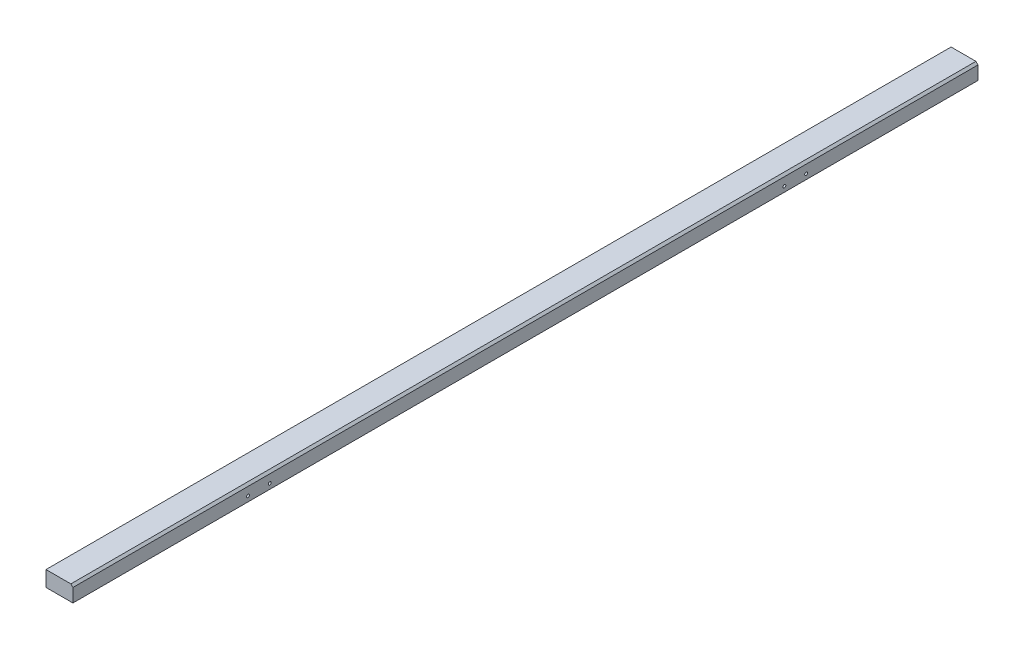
ISO-10303-21;
HEADER;
FILE_DESCRIPTION(('STEP AP214'),'2;1');
FILE_NAME('part.step','',(''),(''),'','','');
FILE_SCHEMA(('AUTOMOTIVE_DESIGN { 1 0 10303 214 1 1 1 1 }'));
ENDSEC;
DATA;
#1=APPLICATION_CONTEXT('core data for automotive mechanical design processes');
#2=APPLICATION_PROTOCOL_DEFINITION('international standard','automotive_design',2000,#1);
#3=PRODUCT_CONTEXT('',#1,'mechanical');
#4=PRODUCT('Part','Part','',(#3));
#5=PRODUCT_RELATED_PRODUCT_CATEGORY('part','',(#4));
#6=PRODUCT_DEFINITION_FORMATION('','',#4);
#7=PRODUCT_DEFINITION_CONTEXT('part definition',#1,'design');
#8=PRODUCT_DEFINITION('design','',#6,#7);
#9=PRODUCT_DEFINITION_SHAPE('','',#8);
#10=(LENGTH_UNIT() NAMED_UNIT(*) SI_UNIT(.MILLI.,.METRE.));
#11=(NAMED_UNIT(*) PLANE_ANGLE_UNIT() SI_UNIT($,.RADIAN.));
#12=(NAMED_UNIT(*) SI_UNIT($,.STERADIAN.) SOLID_ANGLE_UNIT());
#13=UNCERTAINTY_MEASURE_WITH_UNIT(LENGTH_MEASURE(1.E-05),#10,'distance_accuracy_value','');
#14=(GEOMETRIC_REPRESENTATION_CONTEXT(3) GLOBAL_UNCERTAINTY_ASSIGNED_CONTEXT((#13)) GLOBAL_UNIT_ASSIGNED_CONTEXT((#10,
#11,#12)) REPRESENTATION_CONTEXT('',''));
#15=CARTESIAN_POINT('',(0.,0.,0.));
#16=DIRECTION('',(0.,0.,1.));
#17=DIRECTION('',(1.,0.,0.));
#18=AXIS2_PLACEMENT_3D('',#15,#16,#17);
#19=CARTESIAN_POINT('',(0.,0.,1748.));
#20=DIRECTION('',(1.,0.,0.));
#21=DIRECTION('',(0.,0.,-1.));
#22=AXIS2_PLACEMENT_3D('',#19,#20,#21);
#23=PLANE('',#22);
#24=CARTESIAN_POINT('',(0.,10.,1410.));
#25=DIRECTION('',(1.,0.,0.));
#26=DIRECTION('',(0.,0.,-1.));
#27=AXIS2_PLACEMENT_3D('',#24,#25,#26);
#28=CIRCLE('',#27,2.74999999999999);
#29=CARTESIAN_POINT('',(0.,10.,1407.25));
#30=VERTEX_POINT('',#29);
#31=EDGE_CURVE('E140',#30,#30,#28,.T.);
#32=ORIENTED_EDGE('',*,*,#31,.T.);
#33=EDGE_LOOP('',(#32));
#34=FACE_BOUND('',#33,.T.);
#35=CARTESIAN_POINT('',(0.,10.,1368.));
#36=DIRECTION('',(1.,0.,0.));
#37=DIRECTION('',(0.,0.,-1.));
#38=AXIS2_PLACEMENT_3D('',#35,#36,#37);
#39=CIRCLE('',#38,2.74999999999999);
#40=CARTESIAN_POINT('',(0.,10.,1365.25));
#41=VERTEX_POINT('',#40);
#42=EDGE_CURVE('E144',#41,#41,#39,.T.);
#43=ORIENTED_EDGE('',*,*,#42,.T.);
#44=EDGE_LOOP('',(#43));
#45=FACE_BOUND('',#44,.T.);
#46=CARTESIAN_POINT('',(0.,10.,374.));
#47=DIRECTION('',(1.,0.,0.));
#48=DIRECTION('',(0.,0.,-1.));
#49=AXIS2_PLACEMENT_3D('',#46,#47,#48);
#50=CIRCLE('',#49,2.74999999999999);
#51=CARTESIAN_POINT('',(0.,10.,371.25));
#52=VERTEX_POINT('',#51);
#53=EDGE_CURVE('E148',#52,#52,#50,.T.);
#54=ORIENTED_EDGE('',*,*,#53,.T.);
#55=EDGE_LOOP('',(#54));
#56=FACE_BOUND('',#55,.T.);
#57=CARTESIAN_POINT('',(0.,10.,332.));
#58=DIRECTION('',(1.,0.,0.));
#59=DIRECTION('',(0.,0.,-1.));
#60=AXIS2_PLACEMENT_3D('',#57,#58,#59);
#61=CIRCLE('',#60,2.74999999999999);
#62=CARTESIAN_POINT('',(0.,10.,329.25));
#63=VERTEX_POINT('',#62);
#64=EDGE_CURVE('E151',#63,#63,#61,.T.);
#65=ORIENTED_EDGE('',*,*,#64,.T.);
#66=EDGE_LOOP('',(#65));
#67=FACE_BOUND('',#66,.T.);
#68=DIRECTION('',(0.,-1.,0.));
#69=VECTOR('',#68,1.);
#70=CARTESIAN_POINT('',(0.,0.,0.));
#71=LINE('',#70,#69);
#72=CARTESIAN_POINT('',(0.,30.,0.));
#73=VERTEX_POINT('',#72);
#74=CARTESIAN_POINT('',(0.,0.,0.));
#75=VERTEX_POINT('',#74);
#76=EDGE_CURVE('E104',#73,#75,#71,.T.);
#77=ORIENTED_EDGE('',*,*,#76,.T.);
#78=DIRECTION('',(0.,0.,-1.));
#79=VECTOR('',#78,1.);
#80=CARTESIAN_POINT('',(0.,0.,1748.));
#81=LINE('',#80,#79);
#82=CARTESIAN_POINT('',(0.,0.,1748.));
#83=VERTEX_POINT('',#82);
#84=EDGE_CURVE('E11',#83,#75,#81,.T.);
#85=ORIENTED_EDGE('',*,*,#84,.F.);
#86=DIRECTION('',(0.,-1.,0.));
#87=VECTOR('',#86,1.);
#88=CARTESIAN_POINT('',(0.,0.,1748.));
#89=LINE('',#88,#87);
#90=CARTESIAN_POINT('',(0.,30.,1748.));
#91=VERTEX_POINT('',#90);
#92=EDGE_CURVE('E113',#91,#83,#89,.T.);
#93=ORIENTED_EDGE('',*,*,#92,.F.);
#94=DIRECTION('',(0.,0.,-1.));
#95=VECTOR('',#94,1.);
#96=CARTESIAN_POINT('',(0.,30.,1748.));
#97=LINE('',#96,#95);
#98=EDGE_CURVE('E100',#91,#73,#97,.T.);
#99=ORIENTED_EDGE('',*,*,#98,.T.);
#100=EDGE_LOOP('',(#77,#85,#93,#99));
#101=FACE_BOUND('',#100,.T.);
#102=ADVANCED_FACE('F30',(#34,#45,#56,#67,#101),#23,.F.);
#103=CARTESIAN_POINT('',(0.,0.,1748.));
#104=DIRECTION('',(0.,1.,0.));
#105=DIRECTION('',(0.,0.,1.));
#106=AXIS2_PLACEMENT_3D('',#103,#104,#105);
#107=PLANE('',#106);
#108=DIRECTION('',(1.,0.,0.));
#109=VECTOR('',#108,1.);
#110=CARTESIAN_POINT('',(0.,0.,0.));
#111=LINE('',#110,#109);
#112=CARTESIAN_POINT('',(52.,0.,0.));
#113=VERTEX_POINT('',#112);
#114=EDGE_CURVE('E107',#75,#113,#111,.T.);
#115=ORIENTED_EDGE('',*,*,#114,.T.);
#116=DIRECTION('',(0.,0.,-1.));
#117=VECTOR('',#116,1.);
#118=CARTESIAN_POINT('',(52.,0.,1748.));
#119=LINE('',#118,#117);
#120=CARTESIAN_POINT('',(52.,0.,1748.));
#121=VERTEX_POINT('',#120);
#122=EDGE_CURVE('E38',#121,#113,#119,.T.);
#123=ORIENTED_EDGE('',*,*,#122,.F.);
#124=DIRECTION('',(1.,0.,0.));
#125=VECTOR('',#124,1.);
#126=CARTESIAN_POINT('',(0.,0.,1748.));
#127=LINE('',#126,#125);
#128=EDGE_CURVE('E80',#83,#121,#127,.T.);
#129=ORIENTED_EDGE('',*,*,#128,.F.);
#130=ORIENTED_EDGE('',*,*,#84,.T.);
#131=EDGE_LOOP('',(#115,#123,#129,#130));
#132=FACE_BOUND('',#131,.T.);
#133=ADVANCED_FACE('F132',(#132),#107,.F.);
#134=CARTESIAN_POINT('',(52.,0.,1748.));
#135=DIRECTION('',(-1.,0.,0.));
#136=DIRECTION('',(0.,0.,1.));
#137=AXIS2_PLACEMENT_3D('',#134,#135,#136);
#138=PLANE('',#137);
#139=CARTESIAN_POINT('',(52.,10.,1410.));
#140=DIRECTION('',(1.,0.,0.));
#141=DIRECTION('',(0.,0.,-1.));
#142=AXIS2_PLACEMENT_3D('',#139,#140,#141);
#143=CIRCLE('',#142,2.74999999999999);
#144=CARTESIAN_POINT('',(52.,10.,1407.25));
#145=VERTEX_POINT('',#144);
#146=EDGE_CURVE('E166',#145,#145,#143,.T.);
#147=ORIENTED_EDGE('',*,*,#146,.F.);
#148=EDGE_LOOP('',(#147));
#149=FACE_BOUND('',#148,.T.);
#150=CARTESIAN_POINT('',(52.,10.,1368.));
#151=DIRECTION('',(1.,0.,0.));
#152=DIRECTION('',(0.,0.,-1.));
#153=AXIS2_PLACEMENT_3D('',#150,#151,#152);
#154=CIRCLE('',#153,2.74999999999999);
#155=CARTESIAN_POINT('',(52.,10.,1365.25));
#156=VERTEX_POINT('',#155);
#157=EDGE_CURVE('E162',#156,#156,#154,.T.);
#158=ORIENTED_EDGE('',*,*,#157,.F.);
#159=EDGE_LOOP('',(#158));
#160=FACE_BOUND('',#159,.T.);
#161=CARTESIAN_POINT('',(52.,10.,374.));
#162=DIRECTION('',(1.,0.,0.));
#163=DIRECTION('',(0.,0.,-1.));
#164=AXIS2_PLACEMENT_3D('',#161,#162,#163);
#165=CIRCLE('',#164,2.74999999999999);
#166=CARTESIAN_POINT('',(52.,10.,371.25));
#167=VERTEX_POINT('',#166);
#168=EDGE_CURVE('E153',#167,#167,#165,.T.);
#169=ORIENTED_EDGE('',*,*,#168,.F.);
#170=EDGE_LOOP('',(#169));
#171=FACE_BOUND('',#170,.T.);
#172=CARTESIAN_POINT('',(52.,10.,332.));
#173=DIRECTION('',(1.,0.,0.));
#174=DIRECTION('',(0.,0.,-1.));
#175=AXIS2_PLACEMENT_3D('',#172,#173,#174);
#176=CIRCLE('',#175,2.74999999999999);
#177=CARTESIAN_POINT('',(52.,10.,329.25));
#178=VERTEX_POINT('',#177);
#179=EDGE_CURVE('E108',#178,#178,#176,.T.);
#180=ORIENTED_EDGE('',*,*,#179,.F.);
#181=EDGE_LOOP('',(#180));
#182=FACE_BOUND('',#181,.T.);
#183=DIRECTION('',(0.,1.,0.));
#184=VECTOR('',#183,1.);
#185=CARTESIAN_POINT('',(52.,0.,0.));
#186=LINE('',#185,#184);
#187=CARTESIAN_POINT('',(52.,26.,0.));
#188=VERTEX_POINT('',#187);
#189=EDGE_CURVE('E95',#113,#188,#186,.T.);
#190=ORIENTED_EDGE('',*,*,#189,.T.);
#191=DIRECTION('',(0.,0.,-1.));
#192=VECTOR('',#191,1.);
#193=CARTESIAN_POINT('',(52.,26.,1748.));
#194=LINE('',#193,#192);
#195=CARTESIAN_POINT('',(52.,26.,1748.));
#196=VERTEX_POINT('',#195);
#197=EDGE_CURVE('E92',#196,#188,#194,.T.);
#198=ORIENTED_EDGE('',*,*,#197,.F.);
#199=DIRECTION('',(0.,1.,0.));
#200=VECTOR('',#199,1.);
#201=CARTESIAN_POINT('',(52.,0.,1748.));
#202=LINE('',#201,#200);
#203=EDGE_CURVE('E84',#121,#196,#202,.T.);
#204=ORIENTED_EDGE('',*,*,#203,.F.);
#205=ORIENTED_EDGE('',*,*,#122,.T.);
#206=EDGE_LOOP('',(#190,#198,#204,#205));
#207=FACE_BOUND('',#206,.T.);
#208=ADVANCED_FACE('F93',(#149,#160,#171,#182,#207),#138,.F.);
#209=CARTESIAN_POINT('',(48.,30.,1748.));
#210=DIRECTION('',(-0.707106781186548,-0.707106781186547,0.));
#211=DIRECTION('',(0.707106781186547,-0.707106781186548,0.));
#212=AXIS2_PLACEMENT_3D('',#209,#210,#211);
#213=PLANE('',#212);
#214=DIRECTION('',(-0.707106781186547,0.707106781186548,0.));
#215=VECTOR('',#214,1.);
#216=CARTESIAN_POINT('',(48.,30.,0.));
#217=LINE('',#216,#215);
#218=CARTESIAN_POINT('',(48.,30.,0.));
#219=VERTEX_POINT('',#218);
#220=EDGE_CURVE('E66',#188,#219,#217,.T.);
#221=ORIENTED_EDGE('',*,*,#220,.T.);
#222=DIRECTION('',(0.,0.,-1.));
#223=VECTOR('',#222,1.);
#224=CARTESIAN_POINT('',(48.,30.,1748.));
#225=LINE('',#224,#223);
#226=CARTESIAN_POINT('',(48.,30.,1748.));
#227=VERTEX_POINT('',#226);
#228=EDGE_CURVE('E96',#227,#219,#225,.T.);
#229=ORIENTED_EDGE('',*,*,#228,.F.);
#230=DIRECTION('',(-0.707106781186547,0.707106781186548,0.));
#231=VECTOR('',#230,1.);
#232=CARTESIAN_POINT('',(48.,30.,1748.));
#233=LINE('',#232,#231);
#234=EDGE_CURVE('E88',#196,#227,#233,.T.);
#235=ORIENTED_EDGE('',*,*,#234,.F.);
#236=ORIENTED_EDGE('',*,*,#197,.T.);
#237=EDGE_LOOP('',(#221,#229,#235,#236));
#238=FACE_BOUND('',#237,.T.);
#239=ADVANCED_FACE('F98',(#238),#213,.F.);
#240=CARTESIAN_POINT('',(0.,30.,1748.));
#241=DIRECTION('',(0.,-1.,0.));
#242=DIRECTION('',(0.,0.,-1.));
#243=AXIS2_PLACEMENT_3D('',#240,#241,#242);
#244=PLANE('',#243);
#245=DIRECTION('',(-1.,0.,0.));
#246=VECTOR('',#245,1.);
#247=CARTESIAN_POINT('',(0.,30.,0.));
#248=LINE('',#247,#246);
#249=EDGE_CURVE('E72',#219,#73,#248,.T.);
#250=ORIENTED_EDGE('',*,*,#249,.T.);
#251=ORIENTED_EDGE('',*,*,#98,.F.);
#252=DIRECTION('',(-1.,0.,0.));
#253=VECTOR('',#252,1.);
#254=CARTESIAN_POINT('',(0.,30.,1748.));
#255=LINE('',#254,#253);
#256=EDGE_CURVE('E46',#227,#91,#255,.T.);
#257=ORIENTED_EDGE('',*,*,#256,.F.);
#258=ORIENTED_EDGE('',*,*,#228,.T.);
#259=EDGE_LOOP('',(#250,#251,#257,#258));
#260=FACE_BOUND('',#259,.T.);
#261=ADVANCED_FACE('F121',(#260),#244,.F.);
#262=CARTESIAN_POINT('',(0.,30.,1748.));
#263=DIRECTION('',(0.,0.,-1.));
#264=DIRECTION('',(-1.,0.,0.));
#265=AXIS2_PLACEMENT_3D('',#262,#263,#264);
#266=PLANE('',#265);
#267=ORIENTED_EDGE('',*,*,#92,.T.);
#268=ORIENTED_EDGE('',*,*,#128,.T.);
#269=ORIENTED_EDGE('',*,*,#203,.T.);
#270=ORIENTED_EDGE('',*,*,#234,.T.);
#271=ORIENTED_EDGE('',*,*,#256,.T.);
#272=EDGE_LOOP('',(#267,#268,#269,#270,#271));
#273=FACE_BOUND('',#272,.T.);
#274=ADVANCED_FACE('F86',(#273),#266,.F.);
#275=CARTESIAN_POINT('',(0.,30.,0.));
#276=DIRECTION('',(0.,0.,-1.));
#277=DIRECTION('',(-1.,0.,0.));
#278=AXIS2_PLACEMENT_3D('',#275,#276,#277);
#279=PLANE('',#278);
#280=ORIENTED_EDGE('',*,*,#76,.F.);
#281=ORIENTED_EDGE('',*,*,#249,.F.);
#282=ORIENTED_EDGE('',*,*,#220,.F.);
#283=ORIENTED_EDGE('',*,*,#189,.F.);
#284=ORIENTED_EDGE('',*,*,#114,.F.);
#285=EDGE_LOOP('',(#280,#281,#282,#283,#284));
#286=FACE_BOUND('',#285,.T.);
#287=ADVANCED_FACE('F117',(#286),#279,.T.);
#288=CARTESIAN_POINT('',(52.,10.,332.));
#289=DIRECTION('',(1.,0.,0.));
#290=DIRECTION('',(0.,0.,-1.));
#291=AXIS2_PLACEMENT_3D('',#288,#289,#290);
#292=CYLINDRICAL_SURFACE('',#291,2.74999999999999);
#293=ORIENTED_EDGE('',*,*,#64,.F.);
#294=EDGE_LOOP('',(#293));
#295=FACE_BOUND('',#294,.T.);
#296=ORIENTED_EDGE('',*,*,#179,.T.);
#297=EDGE_LOOP('',(#296));
#298=FACE_BOUND('',#297,.T.);
#299=ADVANCED_FACE('F182',(#295,#298),#292,.F.);
#300=CARTESIAN_POINT('',(52.,10.,374.));
#301=DIRECTION('',(1.,0.,0.));
#302=DIRECTION('',(0.,0.,-1.));
#303=AXIS2_PLACEMENT_3D('',#300,#301,#302);
#304=CYLINDRICAL_SURFACE('',#303,2.74999999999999);
#305=ORIENTED_EDGE('',*,*,#53,.F.);
#306=EDGE_LOOP('',(#305));
#307=FACE_BOUND('',#306,.T.);
#308=ORIENTED_EDGE('',*,*,#168,.T.);
#309=EDGE_LOOP('',(#308));
#310=FACE_BOUND('',#309,.T.);
#311=ADVANCED_FACE('F184',(#307,#310),#304,.F.);
#312=CARTESIAN_POINT('',(52.,10.,1368.));
#313=DIRECTION('',(1.,0.,0.));
#314=DIRECTION('',(0.,0.,-1.));
#315=AXIS2_PLACEMENT_3D('',#312,#313,#314);
#316=CYLINDRICAL_SURFACE('',#315,2.74999999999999);
#317=ORIENTED_EDGE('',*,*,#42,.F.);
#318=EDGE_LOOP('',(#317));
#319=FACE_BOUND('',#318,.T.);
#320=ORIENTED_EDGE('',*,*,#157,.T.);
#321=EDGE_LOOP('',(#320));
#322=FACE_BOUND('',#321,.T.);
#323=ADVANCED_FACE('F190',(#319,#322),#316,.F.);
#324=CARTESIAN_POINT('',(52.,10.,1410.));
#325=DIRECTION('',(1.,0.,0.));
#326=DIRECTION('',(0.,0.,-1.));
#327=AXIS2_PLACEMENT_3D('',#324,#325,#326);
#328=CYLINDRICAL_SURFACE('',#327,2.74999999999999);
#329=ORIENTED_EDGE('',*,*,#31,.F.);
#330=EDGE_LOOP('',(#329));
#331=FACE_BOUND('',#330,.T.);
#332=ORIENTED_EDGE('',*,*,#146,.T.);
#333=EDGE_LOOP('',(#332));
#334=FACE_BOUND('',#333,.T.);
#335=ADVANCED_FACE('F171',(#331,#334),#328,.F.);
#336=CLOSED_SHELL('',(#102,#133,#208,#239,#261,#274,#287,#299,#311,#323,#335));
#337=MANIFOLD_SOLID_BREP('B2',#336);
#338=ADVANCED_BREP_SHAPE_REPRESENTATION('',(#18,#337),#14);
#339=SHAPE_DEFINITION_REPRESENTATION(#9,#338);
ENDSEC;
END-ISO-10303-21;
